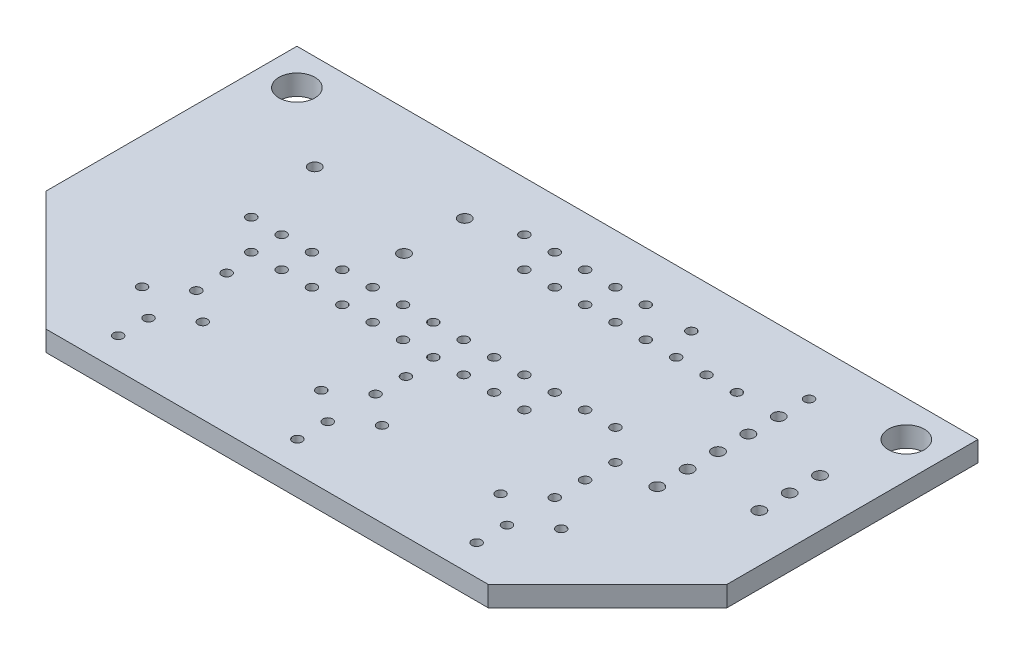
from build123d import *

# Parameters (mm, degrees)
ESQUISSE1_R      = 0.4
ESQUISSE1_R_2    = 1.5
ESQUISSE1_R_3    = 0.5
EXTRUSION1_DEPTH = 1.7


with BuildPart() as part:
    # Esquisse1 → Extrusion1 (new body)
    with BuildSketch(Plane(origin=(0, 0, 0), x_dir=(1, 0, 0), z_dir=(0, 1, 0))):
        Polygon((18.5, 0), (28.5, 10), (28.5, 31), (-28.5, 31), (-28.5, 10), (-18.5, 0), align=None)
        with Locations(Location((0, 2.54, 0), (0, 0, 270))):
            Circle(ESQUISSE1_R, mode=Mode.SUBTRACT)
        with Locations(Location((0, 5.08, 0), (0, 0, 270))):
            Circle(ESQUISSE1_R, mode=Mode.SUBTRACT)
        with Locations(Location((0, 9.08, 0), (0, 0, 270))):
            Circle(ESQUISSE1_R, mode=Mode.SUBTRACT)
        with Locations(Location((0, 11.62, 0), (0, 0, 270))):
            Circle(ESQUISSE1_R, mode=Mode.SUBTRACT)
        with Locations(Location((-2.54, 7.08, 0), (0, 0, 270))):
            Circle(ESQUISSE1_R, mode=Mode.SUBTRACT)
        with Locations(Location((2.54, 7.08, 0), (0, 0, 270))):
            Circle(ESQUISSE1_R, mode=Mode.SUBTRACT)
        with Locations(Location((15, 2.54, 0), (0, 0, 270))):
            Circle(ESQUISSE1_R, mode=Mode.SUBTRACT)
        with Locations(Location((15, 5.08, 0), (0, 0, 270))):
            Circle(ESQUISSE1_R, mode=Mode.SUBTRACT)
        with Locations(Location((17.54, 7.08, 0), (0, 0, 270))):
            Circle(ESQUISSE1_R, mode=Mode.SUBTRACT)
        with Locations(Location((15, 9.08, 0), (0, 0, 270))):
            Circle(ESQUISSE1_R, mode=Mode.SUBTRACT)
        with Locations(Location((12.46, 7.08, 0), (0, 0, 270))):
            Circle(ESQUISSE1_R, mode=Mode.SUBTRACT)
        with Locations(Location((15, 11.62, 0), (0, 0, 270))):
            Circle(ESQUISSE1_R, mode=Mode.SUBTRACT)
        with Locations(Location((-15, 11.62, 0), (0, 0, 90))):
            Circle(ESQUISSE1_R, mode=Mode.SUBTRACT)
        with Locations(Location((-12.46, 7.08, 0), (0, 0, 90))):
            Circle(ESQUISSE1_R, mode=Mode.SUBTRACT)
        with Locations(Location((-15, 9.08, 0), (0, 0, 90))):
            Circle(ESQUISSE1_R, mode=Mode.SUBTRACT)
        with Locations(Location((-17.54, 7.08, 0), (0, 0, 90))):
            Circle(ESQUISSE1_R, mode=Mode.SUBTRACT)
        with Locations(Location((-15, 5.08, 0), (0, 0, 90))):
            Circle(ESQUISSE1_R, mode=Mode.SUBTRACT)
        with Locations(Location((-15, 2.54, 0), (0, 0, 90))):
            Circle(ESQUISSE1_R, mode=Mode.SUBTRACT)
        with Locations(Location((25.5, 28, 0), (0, 0, 270))):
            Circle(ESQUISSE1_R_2, mode=Mode.SUBTRACT)
        with Locations(Location((-25.5, 28, 0), (0, 0, 90))):
            Circle(ESQUISSE1_R_2, mode=Mode.SUBTRACT)
        with Locations(Location((15, 14.16, 0), (0, 0, 270))):
            Circle(ESQUISSE1_R, mode=Mode.SUBTRACT)
        with Locations(Location((18.5, 14.16, 0), (0, 0, 270))):
            Circle(ESQUISSE1_R_3, mode=Mode.SUBTRACT)
        with Locations(Location((-5.32, 14.16, 0), (0, 0, 270))):
            Circle(ESQUISSE1_R, mode=Mode.SUBTRACT)
        with Locations(Location((18.5, 16.7, 0), (0, 0, 270))):
            Circle(ESQUISSE1_R_3, mode=Mode.SUBTRACT)
        with Locations(Location((-5.32, 16.7, 0), (0, 0, 270))):
            Circle(ESQUISSE1_R, mode=Mode.SUBTRACT)
        with Locations(Location((18.5, 19.24, 0), (0, 0, 270))):
            Circle(ESQUISSE1_R_3, mode=Mode.SUBTRACT)
        with Locations(Location((-7.86, 14.16, 0), (0, 0, 270))):
            Circle(ESQUISSE1_R, mode=Mode.SUBTRACT)
        with Locations(Location((18.5, 21.78, 0), (0, 0, 270))):
            Circle(ESQUISSE1_R_3, mode=Mode.SUBTRACT)
        with Locations(Location((15, 24.32, 0), (0, 0, 270))):
            Circle(ESQUISSE1_R, mode=Mode.SUBTRACT)
        with Locations(Location((18.5, 24.32, 0), (0, 0, 270))):
            Circle(ESQUISSE1_R_3, mode=Mode.SUBTRACT)
        with Locations(Location((24.5, 16.7, 0), (0, 0, 270))):
            Circle(ESQUISSE1_R_3, mode=Mode.SUBTRACT)
        with Locations(Location((24.5, 19.24, 0), (0, 0, 270))):
            Circle(ESQUISSE1_R_3, mode=Mode.SUBTRACT)
        with Locations(Location((24.5, 21.78, 0), (0, 0, 270))):
            Circle(ESQUISSE1_R_3, mode=Mode.SUBTRACT)
        with Locations(Location((-7.86, 16.7, 0), (0, 0, 270))):
            Circle(ESQUISSE1_R, mode=Mode.SUBTRACT)
        with Locations(Location((12.46, 16.7, 0), (0, 0, 270))):
            Circle(ESQUISSE1_R, mode=Mode.SUBTRACT)
        with Locations(Location((-10.4, 14.16, 0), (0, 0, 270))):
            Circle(ESQUISSE1_R, mode=Mode.SUBTRACT)
        with Locations(Location((-10.4, 16.7, 0), (0, 0, 270))):
            Circle(ESQUISSE1_R, mode=Mode.SUBTRACT)
        with Locations(Location((12.46, 24.32, 0), (0, 0, 270))):
            Circle(ESQUISSE1_R, mode=Mode.SUBTRACT)
        with Locations(Location((-12.94, 14.16, 0), (0, 0, 270))):
            Circle(ESQUISSE1_R, mode=Mode.SUBTRACT)
        with Locations(Location((9.92, 16.7, 0), (0, 0, 270))):
            Circle(ESQUISSE1_R, mode=Mode.SUBTRACT)
        with Locations(Location((-12.94, 16.7, 0), (0, 0, 270))):
            Circle(ESQUISSE1_R, mode=Mode.SUBTRACT)
        with Locations(Location((-15.48, 14.16, 0), (0, 0, 270))):
            Circle(ESQUISSE1_R, mode=Mode.SUBTRACT)
        with Locations(Location((9.92, 24.32, 0), (0, 0, 270))):
            Circle(ESQUISSE1_R, mode=Mode.SUBTRACT)
        with Locations(Location((7.38, 14.16, 0), (0, 0, 270))):
            Circle(ESQUISSE1_R, mode=Mode.SUBTRACT)
        with Locations(Location((7.38, 16.7, 0), (0, 0, 270))):
            Circle(ESQUISSE1_R, mode=Mode.SUBTRACT)
        with Locations(Location((-15.48, 16.7, 0), (0, 0, 270))):
            Circle(ESQUISSE1_R, mode=Mode.SUBTRACT)
        with Locations(Location((-9, 20.46, 0), (0, 0, 270))):
            Circle(ESQUISSE1_R_3, mode=Mode.SUBTRACT)
        with Locations(Location((7.38, 24.32, 0), (0, 0, 270))):
            Circle(ESQUISSE1_R, mode=Mode.SUBTRACT)
        with Locations(Location((4.84, 14.16, 0), (0, 0, 270))):
            Circle(ESQUISSE1_R, mode=Mode.SUBTRACT)
        with Locations(Location((4.84, 16.7, 0), (0, 0, 270))):
            Circle(ESQUISSE1_R, mode=Mode.SUBTRACT)
        with Locations(Location((-18.02, 16.7, 0), (0, 0, 270))):
            Circle(ESQUISSE1_R, mode=Mode.SUBTRACT)
        with Locations(Location((-9, 25.54, 0), (0, 0, 270))):
            Circle(ESQUISSE1_R_3, mode=Mode.SUBTRACT)
        with Locations(Location((4.84, 24.32, 0), (0, 0, 270))):
            Circle(ESQUISSE1_R, mode=Mode.SUBTRACT)
        with Locations(Location((2.3, 14.16, 0), (0, 0, 270))):
            Circle(ESQUISSE1_R, mode=Mode.SUBTRACT)
        with Locations(Location((2.3, 16.7, 0), (0, 0, 270))):
            Circle(ESQUISSE1_R, mode=Mode.SUBTRACT)
        with Locations(Location((-19.01, 23, 0), (0, 0, 270))):
            Circle(ESQUISSE1_R_3, mode=Mode.SUBTRACT)
        with Locations(Location((18.5, 26.86, 0), (0, 0, 270))):
            Circle(ESQUISSE1_R, mode=Mode.SUBTRACT)
        with Locations(Location((2.3, 24.32, 0), (0, 0, 270))):
            Circle(ESQUISSE1_R, mode=Mode.SUBTRACT)
        with Locations(Location((-0.24, 14.16, 0), (0, 0, 270))):
            Circle(ESQUISSE1_R, mode=Mode.SUBTRACT)
        with Locations(Location((-0.24, 16.7, 0), (0, 0, 270))):
            Circle(ESQUISSE1_R, mode=Mode.SUBTRACT)
        with Locations(Location((4.84, 26.86, 0), (0, 0, 270))):
            Circle(ESQUISSE1_R, mode=Mode.SUBTRACT)
        with Locations(Location((2.3, 26.86, 0), (0, 0, 270))):
            Circle(ESQUISSE1_R, mode=Mode.SUBTRACT)
        with Locations(Location((-0.24, 24.32, 0), (0, 0, 270))):
            Circle(ESQUISSE1_R, mode=Mode.SUBTRACT)
        with Locations(Location((-2.78, 14.16, 0), (0, 0, 270))):
            Circle(ESQUISSE1_R, mode=Mode.SUBTRACT)
        with Locations(Location((-2.78, 16.7, 0), (0, 0, 270))):
            Circle(ESQUISSE1_R, mode=Mode.SUBTRACT)
        with Locations(Location((-0.24, 26.86, 0), (0, 0, 270))):
            Circle(ESQUISSE1_R, mode=Mode.SUBTRACT)
        with Locations(Location((-2.78, 26.86, 0), (0, 0, 270))):
            Circle(ESQUISSE1_R, mode=Mode.SUBTRACT)
        with Locations(Location((-2.78, 24.32, 0), (0, 0, 270))):
            Circle(ESQUISSE1_R, mode=Mode.SUBTRACT)
        with Locations(Location((-5.32, 26.86, 0), (0, 0, 270))):
            Circle(ESQUISSE1_R, mode=Mode.SUBTRACT)
        with Locations(Location((8.65, 26.86, 0), (0, 0, 270))):
            Circle(ESQUISSE1_R, mode=Mode.SUBTRACT)
    extrude(amount=EXTRUSION1_DEPTH)


solid = part.part
